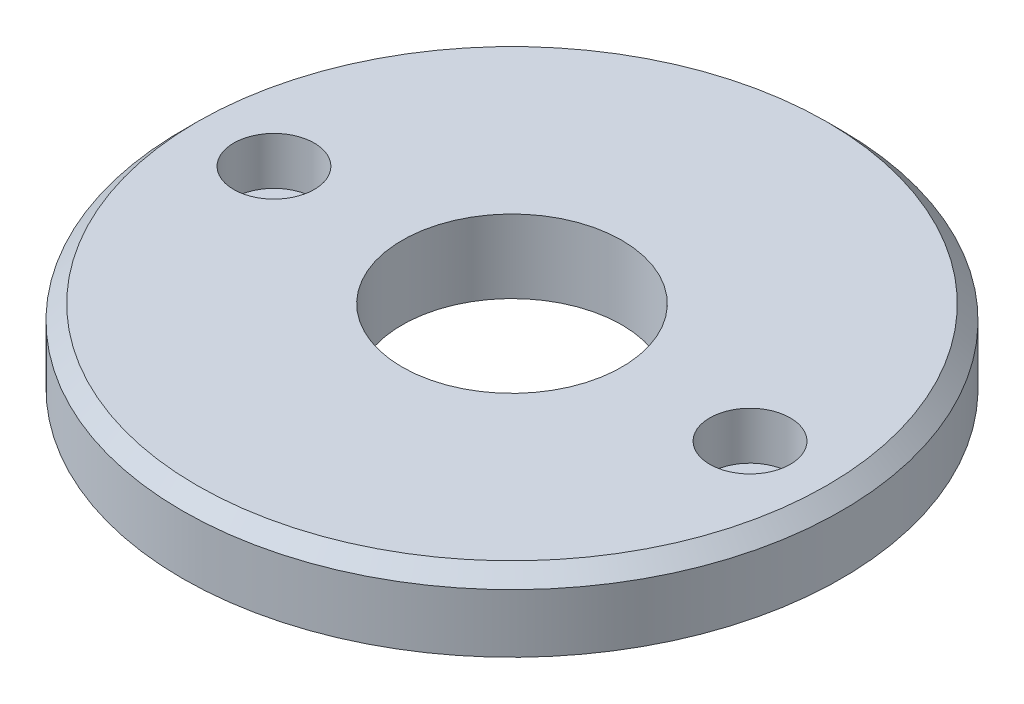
ISO-10303-21;
HEADER;
FILE_DESCRIPTION(('STEP AP214'),'2;1');
FILE_NAME('part.step','',(''),(''),'','','');
FILE_SCHEMA(('AUTOMOTIVE_DESIGN { 1 0 10303 214 1 1 1 1 }'));
ENDSEC;
DATA;
#1=APPLICATION_CONTEXT('core data for automotive mechanical design processes');
#2=APPLICATION_PROTOCOL_DEFINITION('international standard','automotive_design',2000,#1);
#3=PRODUCT_CONTEXT('',#1,'mechanical');
#4=PRODUCT('Part','Part','',(#3));
#5=PRODUCT_RELATED_PRODUCT_CATEGORY('part','',(#4));
#6=PRODUCT_DEFINITION_FORMATION('','',#4);
#7=PRODUCT_DEFINITION_CONTEXT('part definition',#1,'design');
#8=PRODUCT_DEFINITION('design','',#6,#7);
#9=PRODUCT_DEFINITION_SHAPE('','',#8);
#10=(LENGTH_UNIT() NAMED_UNIT(*) SI_UNIT(.MILLI.,.METRE.));
#11=(NAMED_UNIT(*) PLANE_ANGLE_UNIT() SI_UNIT($,.RADIAN.));
#12=(NAMED_UNIT(*) SI_UNIT($,.STERADIAN.) SOLID_ANGLE_UNIT());
#13=UNCERTAINTY_MEASURE_WITH_UNIT(LENGTH_MEASURE(1.E-05),#10,'distance_accuracy_value','');
#14=(GEOMETRIC_REPRESENTATION_CONTEXT(3) GLOBAL_UNCERTAINTY_ASSIGNED_CONTEXT((#13)) GLOBAL_UNIT_ASSIGNED_CONTEXT((#10,
#11,#12)) REPRESENTATION_CONTEXT('',''));
#15=CARTESIAN_POINT('',(0.,0.,0.));
#16=DIRECTION('',(0.,0.,1.));
#17=DIRECTION('',(1.,0.,0.));
#18=AXIS2_PLACEMENT_3D('',#15,#16,#17);
#19=CARTESIAN_POINT('',(0.,0.,0.));
#20=DIRECTION('',(0.,-1.,0.));
#21=DIRECTION('',(0.,0.,-1.));
#22=AXIS2_PLACEMENT_3D('',#19,#20,#21);
#23=CYLINDRICAL_SURFACE('',#22,15.);
#24=CARTESIAN_POINT('',(0.,10.,0.));
#25=DIRECTION('',(0.,-1.,0.));
#26=DIRECTION('',(0.,0.,-1.));
#27=AXIS2_PLACEMENT_3D('',#24,#25,#26);
#28=CIRCLE('',#27,15.);
#29=CARTESIAN_POINT('',(0.,10.,-15.));
#30=VERTEX_POINT('',#29);
#31=EDGE_CURVE('E10',#30,#30,#28,.T.);
#32=ORIENTED_EDGE('',*,*,#31,.F.);
#33=EDGE_LOOP('',(#32));
#34=FACE_BOUND('',#33,.T.);
#35=CARTESIAN_POINT('',(0.,0.,0.));
#36=DIRECTION('',(0.,-1.,0.));
#37=DIRECTION('',(0.,0.,-1.));
#38=AXIS2_PLACEMENT_3D('',#35,#36,#37);
#39=CIRCLE('',#38,15.);
#40=CARTESIAN_POINT('',(0.,0.,-15.));
#41=VERTEX_POINT('',#40);
#42=EDGE_CURVE('E33',#41,#41,#39,.T.);
#43=ORIENTED_EDGE('',*,*,#42,.T.);
#44=EDGE_LOOP('',(#43));
#45=FACE_BOUND('',#44,.T.);
#46=ADVANCED_FACE('F14',(#34,#45),#23,.F.);
#47=CARTESIAN_POINT('',(43.,10.,0.));
#48=DIRECTION('',(0.,1.,0.));
#49=DIRECTION('',(0.,0.,1.));
#50=AXIS2_PLACEMENT_3D('',#47,#48,#49);
#51=PLANE('',#50);
#52=CARTESIAN_POINT('',(-32.5,10.,0.));
#53=DIRECTION('',(0.,-1.,0.));
#54=DIRECTION('',(0.,0.,1.));
#55=AXIS2_PLACEMENT_3D('',#52,#53,#54);
#56=CIRCLE('',#55,5.5);
#57=CARTESIAN_POINT('',(-32.5,10.,5.49999999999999));
#58=VERTEX_POINT('',#57);
#59=EDGE_CURVE('E48',#58,#58,#56,.T.);
#60=ORIENTED_EDGE('',*,*,#59,.T.);
#61=EDGE_LOOP('',(#60));
#62=FACE_BOUND('',#61,.T.);
#63=CARTESIAN_POINT('',(32.5,10.,0.));
#64=DIRECTION('',(0.,-1.,0.));
#65=DIRECTION('',(0.,0.,-1.));
#66=AXIS2_PLACEMENT_3D('',#63,#64,#65);
#67=CIRCLE('',#66,5.5);
#68=CARTESIAN_POINT('',(32.5,10.,-5.5));
#69=VERTEX_POINT('',#68);
#70=EDGE_CURVE('E36',#69,#69,#67,.T.);
#71=ORIENTED_EDGE('',*,*,#70,.T.);
#72=EDGE_LOOP('',(#71));
#73=FACE_BOUND('',#72,.T.);
#74=ORIENTED_EDGE('',*,*,#31,.T.);
#75=EDGE_LOOP('',(#74));
#76=FACE_BOUND('',#75,.T.);
#77=CARTESIAN_POINT('',(0.,10.,0.));
#78=DIRECTION('',(0.,-1.,0.));
#79=DIRECTION('',(0.,0.,-1.));
#80=AXIS2_PLACEMENT_3D('',#77,#78,#79);
#81=CIRCLE('',#80,43.);
#82=CARTESIAN_POINT('',(0.,10.,-43.));
#83=VERTEX_POINT('',#82);
#84=EDGE_CURVE('E20',#83,#83,#81,.T.);
#85=ORIENTED_EDGE('',*,*,#84,.F.);
#86=EDGE_LOOP('',(#85));
#87=FACE_BOUND('',#86,.T.);
#88=ADVANCED_FACE('F76',(#62,#73,#76,#87),#51,.T.);
#89=CARTESIAN_POINT('',(0.,8.,0.));
#90=DIRECTION('',(0.,-1.,0.));
#91=DIRECTION('',(0.,0.,-1.));
#92=AXIS2_PLACEMENT_3D('',#89,#90,#91);
#93=CONICAL_SURFACE('',#92,45.,0.785398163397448);
#94=ORIENTED_EDGE('',*,*,#84,.T.);
#95=EDGE_LOOP('',(#94));
#96=FACE_BOUND('',#95,.T.);
#97=CARTESIAN_POINT('',(0.,8.,0.));
#98=DIRECTION('',(0.,-1.,0.));
#99=DIRECTION('',(0.,0.,-1.));
#100=AXIS2_PLACEMENT_3D('',#97,#98,#99);
#101=CIRCLE('',#100,45.);
#102=CARTESIAN_POINT('',(0.,8.,-45.));
#103=VERTEX_POINT('',#102);
#104=EDGE_CURVE('E24',#103,#103,#101,.T.);
#105=ORIENTED_EDGE('',*,*,#104,.F.);
#106=EDGE_LOOP('',(#105));
#107=FACE_BOUND('',#106,.T.);
#108=ADVANCED_FACE('F83',(#96,#107),#93,.T.);
#109=CARTESIAN_POINT('',(0.,0.,0.));
#110=DIRECTION('',(0.,-1.,0.));
#111=DIRECTION('',(0.,0.,-1.));
#112=AXIS2_PLACEMENT_3D('',#109,#110,#111);
#113=CYLINDRICAL_SURFACE('',#112,45.);
#114=ORIENTED_EDGE('',*,*,#104,.T.);
#115=EDGE_LOOP('',(#114));
#116=FACE_BOUND('',#115,.T.);
#117=CARTESIAN_POINT('',(0.,0.,0.));
#118=DIRECTION('',(0.,-1.,0.));
#119=DIRECTION('',(0.,0.,-1.));
#120=AXIS2_PLACEMENT_3D('',#117,#118,#119);
#121=CIRCLE('',#120,45.);
#122=CARTESIAN_POINT('',(0.,0.,-45.));
#123=VERTEX_POINT('',#122);
#124=EDGE_CURVE('E28',#123,#123,#121,.T.);
#125=ORIENTED_EDGE('',*,*,#124,.F.);
#126=EDGE_LOOP('',(#125));
#127=FACE_BOUND('',#126,.T.);
#128=ADVANCED_FACE('F67',(#116,#127),#113,.T.);
#129=CARTESIAN_POINT('',(15.,0.,0.));
#130=DIRECTION('',(0.,-1.,0.));
#131=DIRECTION('',(0.,0.,-1.));
#132=AXIS2_PLACEMENT_3D('',#129,#130,#131);
#133=PLANE('',#132);
#134=CARTESIAN_POINT('',(-32.5,0.,0.));
#135=DIRECTION('',(0.,-1.,0.));
#136=DIRECTION('',(0.,0.,1.));
#137=AXIS2_PLACEMENT_3D('',#134,#135,#136);
#138=CIRCLE('',#137,3.5);
#139=CARTESIAN_POINT('',(-32.5,0.,3.5));
#140=VERTEX_POINT('',#139);
#141=EDGE_CURVE('E57',#140,#140,#138,.T.);
#142=ORIENTED_EDGE('',*,*,#141,.F.);
#143=EDGE_LOOP('',(#142));
#144=FACE_BOUND('',#143,.T.);
#145=CARTESIAN_POINT('',(32.5,0.,0.));
#146=DIRECTION('',(0.,-1.,0.));
#147=DIRECTION('',(0.,0.,-1.));
#148=AXIS2_PLACEMENT_3D('',#145,#146,#147);
#149=CIRCLE('',#148,3.5);
#150=CARTESIAN_POINT('',(32.5,0.,-3.5));
#151=VERTEX_POINT('',#150);
#152=EDGE_CURVE('E45',#151,#151,#149,.T.);
#153=ORIENTED_EDGE('',*,*,#152,.F.);
#154=EDGE_LOOP('',(#153));
#155=FACE_BOUND('',#154,.T.);
#156=ORIENTED_EDGE('',*,*,#124,.T.);
#157=EDGE_LOOP('',(#156));
#158=FACE_BOUND('',#157,.T.);
#159=ORIENTED_EDGE('',*,*,#42,.F.);
#160=EDGE_LOOP('',(#159));
#161=FACE_BOUND('',#160,.T.);
#162=ADVANCED_FACE('F63',(#144,#155,#158,#161),#133,.T.);
#163=CARTESIAN_POINT('',(32.5,0.,0.));
#164=DIRECTION('',(0.,-1.,0.));
#165=DIRECTION('',(0.,0.,-1.));
#166=AXIS2_PLACEMENT_3D('',#163,#164,#165);
#167=CYLINDRICAL_SURFACE('',#166,5.5);
#168=ORIENTED_EDGE('',*,*,#70,.F.);
#169=EDGE_LOOP('',(#168));
#170=FACE_BOUND('',#169,.T.);
#171=CARTESIAN_POINT('',(32.5,3.5,0.));
#172=DIRECTION('',(0.,-1.,0.));
#173=DIRECTION('',(0.,0.,-1.));
#174=AXIS2_PLACEMENT_3D('',#171,#172,#173);
#175=CIRCLE('',#174,5.5);
#176=CARTESIAN_POINT('',(32.5,3.5,-5.5));
#177=VERTEX_POINT('',#176);
#178=EDGE_CURVE('E39',#177,#177,#175,.T.);
#179=ORIENTED_EDGE('',*,*,#178,.T.);
#180=EDGE_LOOP('',(#179));
#181=FACE_BOUND('',#180,.T.);
#182=ADVANCED_FACE('F66',(#170,#181),#167,.F.);
#183=CARTESIAN_POINT('',(36.,3.5,0.));
#184=DIRECTION('',(0.,-1.,0.));
#185=DIRECTION('',(0.,0.,-1.));
#186=AXIS2_PLACEMENT_3D('',#183,#184,#185);
#187=PLANE('',#186);
#188=ORIENTED_EDGE('',*,*,#178,.F.);
#189=EDGE_LOOP('',(#188));
#190=FACE_BOUND('',#189,.T.);
#191=CARTESIAN_POINT('',(32.5,3.5,0.));
#192=DIRECTION('',(0.,-1.,0.));
#193=DIRECTION('',(0.,0.,-1.));
#194=AXIS2_PLACEMENT_3D('',#191,#192,#193);
#195=CIRCLE('',#194,3.5);
#196=CARTESIAN_POINT('',(32.5,3.5,-3.5));
#197=VERTEX_POINT('',#196);
#198=EDGE_CURVE('E42',#197,#197,#195,.T.);
#199=ORIENTED_EDGE('',*,*,#198,.T.);
#200=EDGE_LOOP('',(#199));
#201=FACE_BOUND('',#200,.T.);
#202=ADVANCED_FACE('F97',(#190,#201),#187,.F.);
#203=CARTESIAN_POINT('',(32.5,0.,0.));
#204=DIRECTION('',(0.,-1.,0.));
#205=DIRECTION('',(0.,0.,-1.));
#206=AXIS2_PLACEMENT_3D('',#203,#204,#205);
#207=CYLINDRICAL_SURFACE('',#206,3.5);
#208=ORIENTED_EDGE('',*,*,#198,.F.);
#209=EDGE_LOOP('',(#208));
#210=FACE_BOUND('',#209,.T.);
#211=ORIENTED_EDGE('',*,*,#152,.T.);
#212=EDGE_LOOP('',(#211));
#213=FACE_BOUND('',#212,.T.);
#214=ADVANCED_FACE('F101',(#210,#213),#207,.F.);
#215=CARTESIAN_POINT('',(-32.5,0.,0.));
#216=DIRECTION('',(0.,-1.,0.));
#217=DIRECTION('',(0.,0.,1.));
#218=AXIS2_PLACEMENT_3D('',#215,#216,#217);
#219=CYLINDRICAL_SURFACE('',#218,5.5);
#220=ORIENTED_EDGE('',*,*,#59,.F.);
#221=EDGE_LOOP('',(#220));
#222=FACE_BOUND('',#221,.T.);
#223=CARTESIAN_POINT('',(-32.5,3.5,0.));
#224=DIRECTION('',(0.,-1.,0.));
#225=DIRECTION('',(0.,0.,1.));
#226=AXIS2_PLACEMENT_3D('',#223,#224,#225);
#227=CIRCLE('',#226,5.5);
#228=CARTESIAN_POINT('',(-32.5,3.5,5.49999999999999));
#229=VERTEX_POINT('',#228);
#230=EDGE_CURVE('E51',#229,#229,#227,.T.);
#231=ORIENTED_EDGE('',*,*,#230,.T.);
#232=EDGE_LOOP('',(#231));
#233=FACE_BOUND('',#232,.T.);
#234=ADVANCED_FACE('F105',(#222,#233),#219,.F.);
#235=CARTESIAN_POINT('',(-36.,3.5,0.));
#236=DIRECTION('',(0.,-1.,0.));
#237=DIRECTION('',(0.,0.,1.));
#238=AXIS2_PLACEMENT_3D('',#235,#236,#237);
#239=PLANE('',#238);
#240=ORIENTED_EDGE('',*,*,#230,.F.);
#241=EDGE_LOOP('',(#240));
#242=FACE_BOUND('',#241,.T.);
#243=CARTESIAN_POINT('',(-32.5,3.5,0.));
#244=DIRECTION('',(0.,-1.,0.));
#245=DIRECTION('',(0.,0.,1.));
#246=AXIS2_PLACEMENT_3D('',#243,#244,#245);
#247=CIRCLE('',#246,3.5);
#248=CARTESIAN_POINT('',(-32.5,3.5,3.5));
#249=VERTEX_POINT('',#248);
#250=EDGE_CURVE('E54',#249,#249,#247,.T.);
#251=ORIENTED_EDGE('',*,*,#250,.T.);
#252=EDGE_LOOP('',(#251));
#253=FACE_BOUND('',#252,.T.);
#254=ADVANCED_FACE('F109',(#242,#253),#239,.F.);
#255=CARTESIAN_POINT('',(-32.5,0.,0.));
#256=DIRECTION('',(0.,-1.,0.));
#257=DIRECTION('',(0.,0.,1.));
#258=AXIS2_PLACEMENT_3D('',#255,#256,#257);
#259=CYLINDRICAL_SURFACE('',#258,3.5);
#260=ORIENTED_EDGE('',*,*,#250,.F.);
#261=EDGE_LOOP('',(#260));
#262=FACE_BOUND('',#261,.T.);
#263=ORIENTED_EDGE('',*,*,#141,.T.);
#264=EDGE_LOOP('',(#263));
#265=FACE_BOUND('',#264,.T.);
#266=ADVANCED_FACE('F61',(#262,#265),#259,.F.);
#267=CLOSED_SHELL('',(#46,#88,#108,#128,#162,#182,#202,#214,#234,#254,#266));
#268=MANIFOLD_SOLID_BREP('B1',#267);
#269=ADVANCED_BREP_SHAPE_REPRESENTATION('',(#18,#268),#14);
#270=SHAPE_DEFINITION_REPRESENTATION(#9,#269);
ENDSEC;
END-ISO-10303-21;
